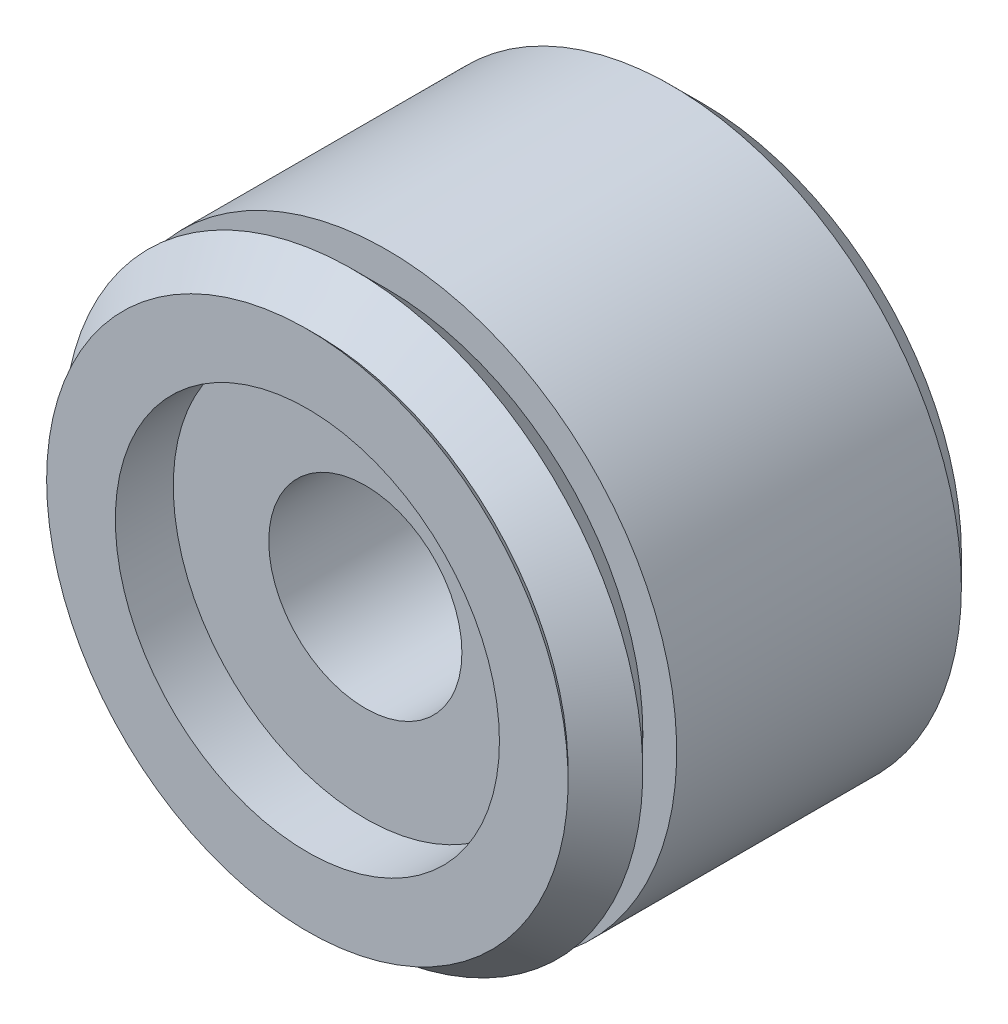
from build123d import *

# Parameters (mm, degrees)
BACK_CHAMFER_SIZE  = 0.79375
SKETCH3_R          = 2.54
HOLE_CUT_DEPTH     = 15.957963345
SKETCH14_R         = 5.050924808
CUT_EXTRUDE1_DEPTH = 1.524


with BuildPart() as part:
    # Sketch1 → Base (revolve)
    with BuildSketch(Plane(origin=(0, 0, 0), x_dir=(0, 0, -1), z_dir=(1, 0, 0)), mode=Mode.PRIVATE) as base_sk:
        Polygon((0, 0), (0, 6.858), (0.21971, 6.63829), (1.20142, 7.62), (2.093214, 6.728206), (2.093214, 7.62), (10.373614, 7.62), (10.373614, 0), align=None)
    revolve(base_sk.sketch.rotate(Axis((0, 0, -71.294124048), (0, 0, 1)), 90), axis=Axis((0, 0, -71.294124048), (0, 0, 1)))

    # Back Chamfer
    back_chamfer_edges = [part.edges().sort_by_distance(p)[0] for p in [
        (7.62, 0, -10.373614),
    ]]
    chamfer(back_chamfer_edges, length=BACK_CHAMFER_SIZE)

    # Sketch3 → Hole Cut (cut, through all)
    with BuildSketch(Plane(origin=(0, 0, 0), x_dir=(-1, 0, 0), z_dir=(0, 0, -1))):
        Circle(SKETCH3_R)
    extrude(amount=HOLE_CUT_DEPTH, mode=Mode.SUBTRACT)

    # Sketch14 → Cut-Extrude1 (cut)
    with BuildSketch(Plane.XY):
        Circle(SKETCH14_R)
    extrude(amount=-CUT_EXTRUDE1_DEPTH, mode=Mode.SUBTRACT)


solid = part.part
